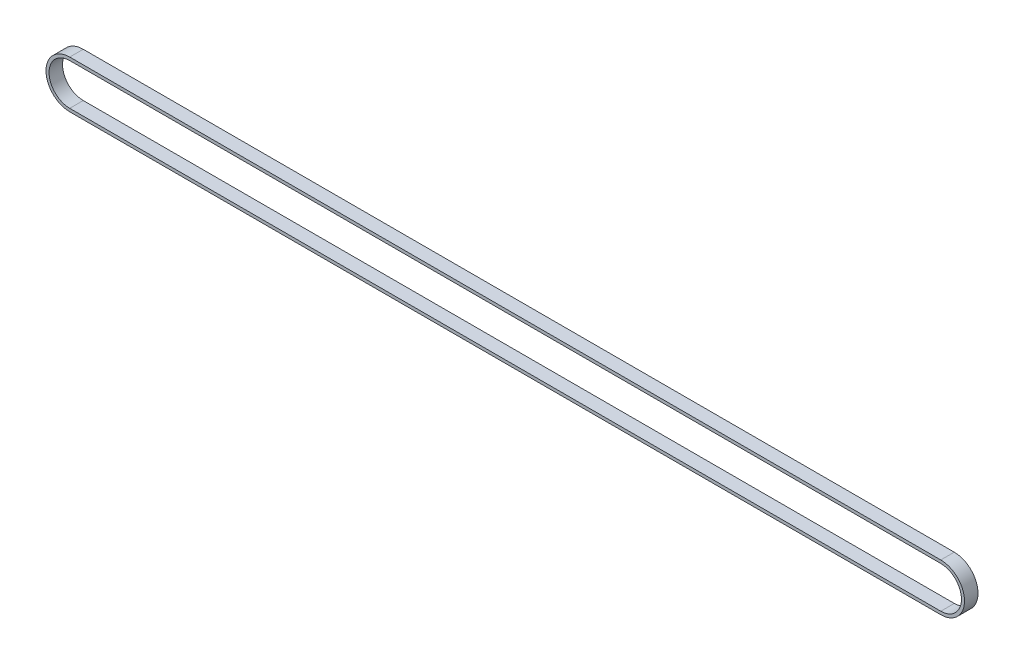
from build123d import *

# Parameters (mm, degrees)
BOSS_EXTRUDE1_DEPTH = 3


with BuildPart() as part:
    # Sketch2 → Boss-Extrude1 (new, symmetric)
    with BuildSketch(Plane.XY):
        with BuildLine():
            Line((-193.5, 10.541), (193.5, 10.541))
            ThreePointArc((193.5, 10.541), (204.041, 0), (193.5, -10.541))
            Line((193.5, -10.541), (-193.5, -10.541))
            ThreePointArc((-193.5, -10.541), (-204.041, 0), (-193.5, 10.541))
        make_face()
        with BuildLine():
            Line((-193.5, 9.181), (193.5, 9.181))
            ThreePointArc((193.5, 9.181), (202.681, 0), (193.5, -9.181))
            Line((193.5, -9.181), (-193.5, -9.181))
            ThreePointArc((-193.5, -9.181), (-202.681, 0), (-193.5, 9.181))
        make_face(mode=Mode.SUBTRACT)
    extrude(amount=BOSS_EXTRUDE1_DEPTH, both=True)


solid = part.part
